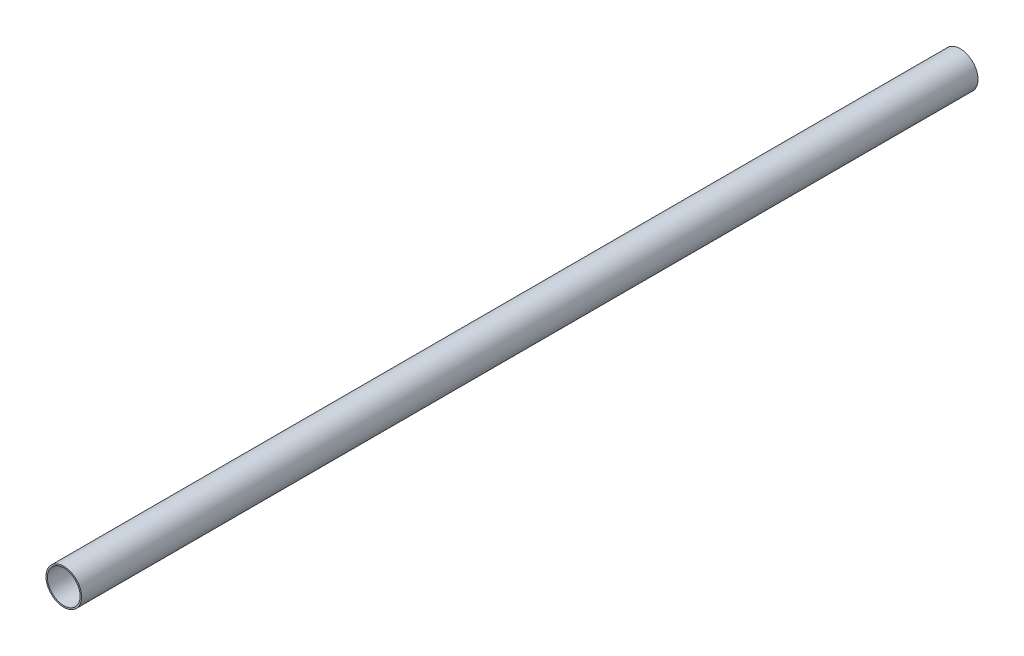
from build123d import *

# Parameters (mm, degrees)
ESQUISSE1_R      = 12.5
ESQUISSE1_R_2    = 11.5
EXTRUSION1_DEPTH = 630


with BuildPart() as part:
    # Esquisse1 → Extrusion1 (new body)
    with BuildSketch(Plane.XY):
        Circle(ESQUISSE1_R)
        Circle(ESQUISSE1_R_2, mode=Mode.SUBTRACT)
    extrude(amount=EXTRUSION1_DEPTH)


solid = part.part
